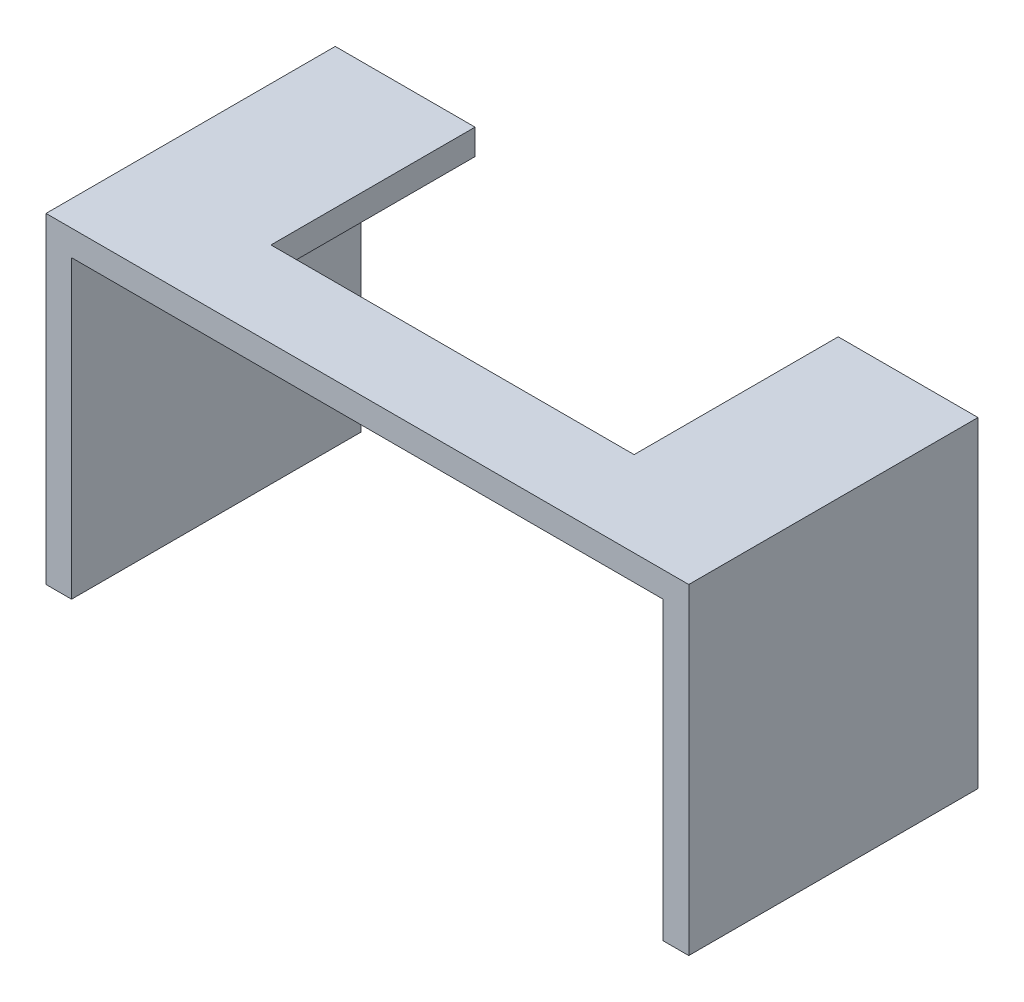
from build123d import *

# Parameters (mm, degrees)
BOSS_EXTRUDE1_DEPTH = 18
SKETCH2_W           = 22.6
SKETCH2_H           = 12.7
CUT_EXTRUDE1_DEPTH  = 10


with BuildPart() as part:
    # Sketch1 → Boss-Extrude1 (new body)
    with BuildSketch(Plane.XY):
        Polygon((1.59, -20), (1.59, -1.59), (38.41, -1.59), (38.41, -20), (40, -20), (40, 0), (0, 0), (0, -20), align=None)
    extrude(amount=BOSS_EXTRUDE1_DEPTH)

    # Sketch2 → Cut-Extrude1 (cut)
    with BuildSketch(Plane(origin=(0, 0, 0), x_dir=(1, 0, 0), z_dir=(0, 1, 0))):
        with Locations((20, -6.35)):
            Rectangle(SKETCH2_W, SKETCH2_H)
    extrude(amount=-CUT_EXTRUDE1_DEPTH, mode=Mode.SUBTRACT)


solid = part.part
